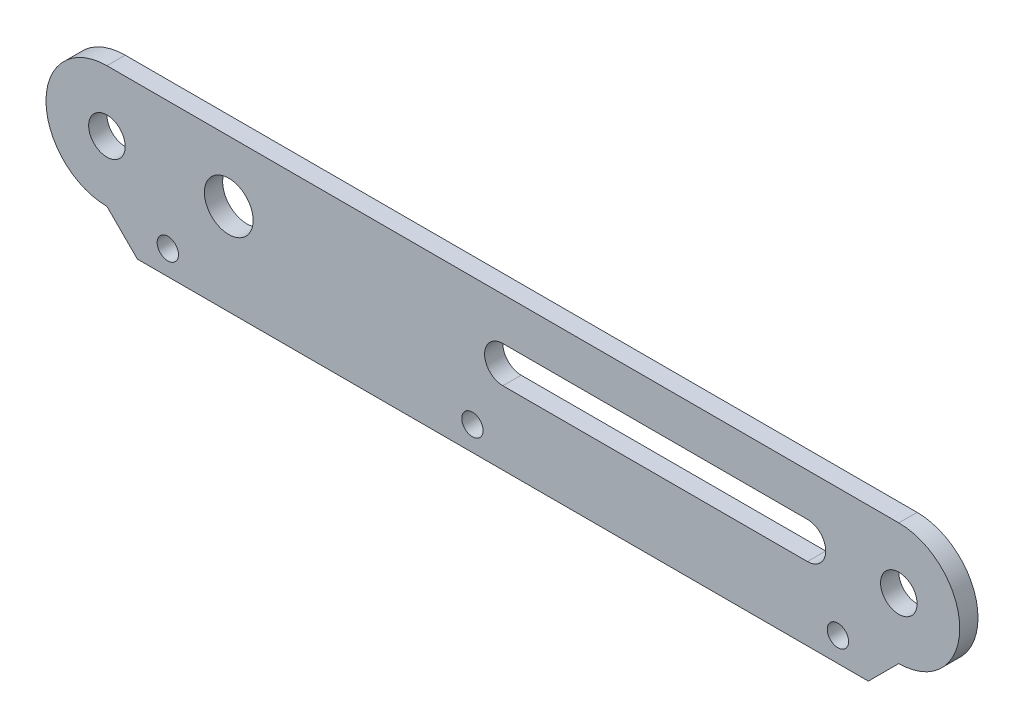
ISO-10303-21;
HEADER;
FILE_DESCRIPTION(('STEP AP214'),'2;1');
FILE_NAME('part.step','',(''),(''),'','','');
FILE_SCHEMA(('AUTOMOTIVE_DESIGN { 1 0 10303 214 1 1 1 1 }'));
ENDSEC;
DATA;
#1=APPLICATION_CONTEXT('core data for automotive mechanical design processes');
#2=APPLICATION_PROTOCOL_DEFINITION('international standard','automotive_design',2000,#1);
#3=PRODUCT_CONTEXT('',#1,'mechanical');
#4=PRODUCT('Part','Part','',(#3));
#5=PRODUCT_RELATED_PRODUCT_CATEGORY('part','',(#4));
#6=PRODUCT_DEFINITION_FORMATION('','',#4);
#7=PRODUCT_DEFINITION_CONTEXT('part definition',#1,'design');
#8=PRODUCT_DEFINITION('design','',#6,#7);
#9=PRODUCT_DEFINITION_SHAPE('','',#8);
#10=(LENGTH_UNIT() NAMED_UNIT(*) SI_UNIT(.MILLI.,.METRE.));
#11=(NAMED_UNIT(*) PLANE_ANGLE_UNIT() SI_UNIT($,.RADIAN.));
#12=(NAMED_UNIT(*) SI_UNIT($,.STERADIAN.) SOLID_ANGLE_UNIT());
#13=UNCERTAINTY_MEASURE_WITH_UNIT(LENGTH_MEASURE(1.E-05),#10,'distance_accuracy_value','');
#14=(GEOMETRIC_REPRESENTATION_CONTEXT(3) GLOBAL_UNCERTAINTY_ASSIGNED_CONTEXT((#13)) GLOBAL_UNIT_ASSIGNED_CONTEXT((#10,
#11,#12)) REPRESENTATION_CONTEXT('',''));
#15=CARTESIAN_POINT('',(0.,0.,0.));
#16=DIRECTION('',(0.,0.,1.));
#17=DIRECTION('',(1.,0.,0.));
#18=AXIS2_PLACEMENT_3D('',#15,#16,#17);
#19=CARTESIAN_POINT('',(0.,0.,3.));
#20=DIRECTION('',(0.,0.,1.));
#21=DIRECTION('',(1.,0.,0.));
#22=AXIS2_PLACEMENT_3D('',#19,#20,#21);
#23=PLANE('',#22);
#24=CARTESIAN_POINT('',(60.,-11.,3.));
#25=DIRECTION('',(0.,0.,1.));
#26=DIRECTION('',(1.,0.,0.));
#27=AXIS2_PLACEMENT_3D('',#24,#25,#26);
#28=CIRCLE('',#27,1.75);
#29=CARTESIAN_POINT('',(61.75,-11.,3.));
#30=VERTEX_POINT('',#29);
#31=EDGE_CURVE('E300',#30,#30,#28,.T.);
#32=ORIENTED_EDGE('',*,*,#31,.F.);
#33=EDGE_LOOP('',(#32));
#34=FACE_BOUND('',#33,.T.);
#35=DIRECTION('',(1.,0.,0.));
#36=VECTOR('',#35,1.);
#37=CARTESIAN_POINT('',(65.,-3.,3.));
#38=LINE('',#37,#36);
#39=CARTESIAN_POINT('',(65.,-3.,3.));
#40=VERTEX_POINT('',#39);
#41=CARTESIAN_POINT('',(115.,-3.,3.));
#42=VERTEX_POINT('',#41);
#43=EDGE_CURVE('E118',#40,#42,#38,.T.);
#44=ORIENTED_EDGE('',*,*,#43,.F.);
#45=CARTESIAN_POINT('',(65.,0.,3.));
#46=DIRECTION('',(0.,0.,1.));
#47=DIRECTION('',(1.,0.,0.));
#48=AXIS2_PLACEMENT_3D('',#45,#46,#47);
#49=CIRCLE('',#48,3.);
#50=CARTESIAN_POINT('',(65.,3.,3.));
#51=VERTEX_POINT('',#50);
#52=EDGE_CURVE('E110',#51,#40,#49,.T.);
#53=ORIENTED_EDGE('',*,*,#52,.F.);
#54=DIRECTION('',(-1.,0.,0.));
#55=VECTOR('',#54,1.);
#56=CARTESIAN_POINT('',(65.,3.,3.));
#57=LINE('',#56,#55);
#58=CARTESIAN_POINT('',(115.,3.,3.));
#59=VERTEX_POINT('',#58);
#60=EDGE_CURVE('E133',#59,#51,#57,.T.);
#61=ORIENTED_EDGE('',*,*,#60,.F.);
#62=CARTESIAN_POINT('',(115.,0.,3.));
#63=DIRECTION('',(0.,0.,1.));
#64=DIRECTION('',(1.,0.,0.));
#65=AXIS2_PLACEMENT_3D('',#62,#63,#64);
#66=CIRCLE('',#65,3.);
#67=EDGE_CURVE('E131',#42,#59,#66,.T.);
#68=ORIENTED_EDGE('',*,*,#67,.F.);
#69=EDGE_LOOP('',(#44,#53,#61,#68));
#70=FACE_BOUND('',#69,.T.);
#71=CARTESIAN_POINT('',(130.,0.,3.));
#72=DIRECTION('',(0.,0.,1.));
#73=DIRECTION('',(1.,0.,0.));
#74=AXIS2_PLACEMENT_3D('',#71,#72,#73);
#75=CIRCLE('',#74,2.99999999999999);
#76=CARTESIAN_POINT('',(133.,0.,3.));
#77=VERTEX_POINT('',#76);
#78=EDGE_CURVE('E149',#77,#77,#75,.T.);
#79=ORIENTED_EDGE('',*,*,#78,.F.);
#80=EDGE_LOOP('',(#79));
#81=FACE_BOUND('',#80,.T.);
#82=CARTESIAN_POINT('',(0.,0.,3.));
#83=DIRECTION('',(0.,0.,1.));
#84=DIRECTION('',(1.,0.,0.));
#85=AXIS2_PLACEMENT_3D('',#82,#83,#84);
#86=CIRCLE('',#85,3.);
#87=CARTESIAN_POINT('',(3.,0.,3.));
#88=VERTEX_POINT('',#87);
#89=EDGE_CURVE('E161',#88,#88,#86,.T.);
#90=ORIENTED_EDGE('',*,*,#89,.F.);
#91=EDGE_LOOP('',(#90));
#92=FACE_BOUND('',#91,.T.);
#93=CARTESIAN_POINT('',(0.,0.,3.));
#94=DIRECTION('',(0.,0.,1.));
#95=DIRECTION('',(1.,0.,0.));
#96=AXIS2_PLACEMENT_3D('',#93,#94,#95);
#97=CIRCLE('',#96,10.);
#98=CARTESIAN_POINT('',(0.,10.,3.));
#99=VERTEX_POINT('',#98);
#100=CARTESIAN_POINT('',(0.,-10.,3.));
#101=VERTEX_POINT('',#100);
#102=EDGE_CURVE('E167',#99,#101,#97,.T.);
#103=ORIENTED_EDGE('',*,*,#102,.T.);
#104=DIRECTION('',(0.707106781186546,-0.707106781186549,0.));
#105=VECTOR('',#104,1.);
#106=CARTESIAN_POINT('',(0.,-10.,3.));
#107=LINE('',#106,#105);
#108=CARTESIAN_POINT('',(4.99999999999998,-15.,3.));
#109=VERTEX_POINT('',#108);
#110=EDGE_CURVE('E170',#101,#109,#107,.T.);
#111=ORIENTED_EDGE('',*,*,#110,.T.);
#112=DIRECTION('',(1.,0.,0.));
#113=VECTOR('',#112,1.);
#114=CARTESIAN_POINT('',(4.99999999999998,-15.,3.));
#115=LINE('',#114,#113);
#116=CARTESIAN_POINT('',(125.,-15.,3.));
#117=VERTEX_POINT('',#116);
#118=EDGE_CURVE('E173',#109,#117,#115,.T.);
#119=ORIENTED_EDGE('',*,*,#118,.T.);
#120=DIRECTION('',(0.707106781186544,0.707106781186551,0.));
#121=VECTOR('',#120,1.);
#122=CARTESIAN_POINT('',(125.,-15.,3.));
#123=LINE('',#122,#121);
#124=CARTESIAN_POINT('',(130.,-10.,3.));
#125=VERTEX_POINT('',#124);
#126=EDGE_CURVE('E175',#117,#125,#123,.T.);
#127=ORIENTED_EDGE('',*,*,#126,.T.);
#128=CARTESIAN_POINT('',(130.,0.,3.));
#129=DIRECTION('',(0.,0.,1.));
#130=DIRECTION('',(1.,0.,0.));
#131=AXIS2_PLACEMENT_3D('',#128,#129,#130);
#132=CIRCLE('',#131,10.);
#133=CARTESIAN_POINT('',(130.,10.,3.));
#134=VERTEX_POINT('',#133);
#135=EDGE_CURVE('E177',#125,#134,#132,.T.);
#136=ORIENTED_EDGE('',*,*,#135,.T.);
#137=DIRECTION('',(-1.,0.,0.));
#138=VECTOR('',#137,1.);
#139=CARTESIAN_POINT('',(0.,10.,3.));
#140=LINE('',#139,#138);
#141=EDGE_CURVE('E179',#134,#99,#140,.T.);
#142=ORIENTED_EDGE('',*,*,#141,.T.);
#143=EDGE_LOOP('',(#103,#111,#119,#127,#136,#142));
#144=FACE_BOUND('',#143,.T.);
#145=CARTESIAN_POINT('',(20.,0.,3.));
#146=DIRECTION('',(0.,0.,1.));
#147=DIRECTION('',(1.,0.,0.));
#148=AXIS2_PLACEMENT_3D('',#145,#146,#147);
#149=CIRCLE('',#148,4.);
#150=CARTESIAN_POINT('',(24.,0.,3.));
#151=VERTEX_POINT('',#150);
#152=EDGE_CURVE('E155',#151,#151,#149,.T.);
#153=ORIENTED_EDGE('',*,*,#152,.F.);
#154=EDGE_LOOP('',(#153));
#155=FACE_BOUND('',#154,.T.);
#156=CARTESIAN_POINT('',(10.,-11.,3.));
#157=DIRECTION('',(0.,0.,1.));
#158=DIRECTION('',(1.,0.,0.));
#159=AXIS2_PLACEMENT_3D('',#156,#157,#158);
#160=CIRCLE('',#159,1.75);
#161=CARTESIAN_POINT('',(11.75,-11.,3.));
#162=VERTEX_POINT('',#161);
#163=EDGE_CURVE('E139',#162,#162,#160,.T.);
#164=ORIENTED_EDGE('',*,*,#163,.F.);
#165=EDGE_LOOP('',(#164));
#166=FACE_BOUND('',#165,.T.);
#167=CARTESIAN_POINT('',(120.,-11.,3.));
#168=DIRECTION('',(0.,0.,1.));
#169=DIRECTION('',(1.,0.,0.));
#170=AXIS2_PLACEMENT_3D('',#167,#168,#169);
#171=CIRCLE('',#170,1.75);
#172=CARTESIAN_POINT('',(121.75,-11.,3.));
#173=VERTEX_POINT('',#172);
#174=EDGE_CURVE('E291',#173,#173,#171,.T.);
#175=ORIENTED_EDGE('',*,*,#174,.F.);
#176=EDGE_LOOP('',(#175));
#177=FACE_BOUND('',#176,.T.);
#178=ADVANCED_FACE('F33',(#34,#70,#81,#92,#144,#155,#166,#177),#23,.T.);
#179=CARTESIAN_POINT('',(0.,0.,0.));
#180=DIRECTION('',(0.,0.,1.));
#181=DIRECTION('',(1.,0.,0.));
#182=AXIS2_PLACEMENT_3D('',#179,#180,#181);
#183=PLANE('',#182);
#184=CARTESIAN_POINT('',(130.,0.,0.));
#185=DIRECTION('',(0.,0.,1.));
#186=DIRECTION('',(1.,0.,0.));
#187=AXIS2_PLACEMENT_3D('',#184,#185,#186);
#188=CIRCLE('',#187,2.99999999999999);
#189=CARTESIAN_POINT('',(133.,0.,0.));
#190=VERTEX_POINT('',#189);
#191=EDGE_CURVE('E126',#190,#190,#188,.T.);
#192=ORIENTED_EDGE('',*,*,#191,.T.);
#193=EDGE_LOOP('',(#192));
#194=FACE_BOUND('',#193,.T.);
#195=CARTESIAN_POINT('',(20.,0.,0.));
#196=DIRECTION('',(0.,0.,1.));
#197=DIRECTION('',(1.,0.,0.));
#198=AXIS2_PLACEMENT_3D('',#195,#196,#197);
#199=CIRCLE('',#198,4.);
#200=CARTESIAN_POINT('',(24.,0.,0.));
#201=VERTEX_POINT('',#200);
#202=EDGE_CURVE('E152',#201,#201,#199,.T.);
#203=ORIENTED_EDGE('',*,*,#202,.T.);
#204=EDGE_LOOP('',(#203));
#205=FACE_BOUND('',#204,.T.);
#206=CARTESIAN_POINT('',(0.,0.,0.));
#207=DIRECTION('',(0.,0.,1.));
#208=DIRECTION('',(1.,0.,0.));
#209=AXIS2_PLACEMENT_3D('',#206,#207,#208);
#210=CIRCLE('',#209,3.);
#211=CARTESIAN_POINT('',(3.,0.,0.));
#212=VERTEX_POINT('',#211);
#213=EDGE_CURVE('E158',#212,#212,#210,.T.);
#214=ORIENTED_EDGE('',*,*,#213,.T.);
#215=EDGE_LOOP('',(#214));
#216=FACE_BOUND('',#215,.T.);
#217=CARTESIAN_POINT('',(0.,0.,0.));
#218=DIRECTION('',(0.,0.,1.));
#219=DIRECTION('',(1.,0.,0.));
#220=AXIS2_PLACEMENT_3D('',#217,#218,#219);
#221=CIRCLE('',#220,10.);
#222=CARTESIAN_POINT('',(0.,10.,0.));
#223=VERTEX_POINT('',#222);
#224=CARTESIAN_POINT('',(0.,-10.,0.));
#225=VERTEX_POINT('',#224);
#226=EDGE_CURVE('E164',#223,#225,#221,.T.);
#227=ORIENTED_EDGE('',*,*,#226,.F.);
#228=DIRECTION('',(-1.,0.,0.));
#229=VECTOR('',#228,1.);
#230=CARTESIAN_POINT('',(0.,10.,0.));
#231=LINE('',#230,#229);
#232=CARTESIAN_POINT('',(130.,10.,0.));
#233=VERTEX_POINT('',#232);
#234=EDGE_CURVE('E171',#233,#223,#231,.T.);
#235=ORIENTED_EDGE('',*,*,#234,.F.);
#236=CARTESIAN_POINT('',(130.,0.,0.));
#237=DIRECTION('',(0.,0.,1.));
#238=DIRECTION('',(1.,0.,0.));
#239=AXIS2_PLACEMENT_3D('',#236,#237,#238);
#240=CIRCLE('',#239,10.);
#241=CARTESIAN_POINT('',(130.,-10.,0.));
#242=VERTEX_POINT('',#241);
#243=EDGE_CURVE('E190',#242,#233,#240,.T.);
#244=ORIENTED_EDGE('',*,*,#243,.F.);
#245=DIRECTION('',(0.707106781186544,0.707106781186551,0.));
#246=VECTOR('',#245,1.);
#247=CARTESIAN_POINT('',(125.,-15.,0.));
#248=LINE('',#247,#246);
#249=CARTESIAN_POINT('',(125.,-15.,0.));
#250=VERTEX_POINT('',#249);
#251=EDGE_CURVE('E188',#250,#242,#248,.T.);
#252=ORIENTED_EDGE('',*,*,#251,.F.);
#253=DIRECTION('',(1.,0.,0.));
#254=VECTOR('',#253,1.);
#255=CARTESIAN_POINT('',(4.99999999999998,-15.,0.));
#256=LINE('',#255,#254);
#257=CARTESIAN_POINT('',(4.99999999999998,-15.,0.));
#258=VERTEX_POINT('',#257);
#259=EDGE_CURVE('E186',#258,#250,#256,.T.);
#260=ORIENTED_EDGE('',*,*,#259,.F.);
#261=DIRECTION('',(0.707106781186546,-0.707106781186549,0.));
#262=VECTOR('',#261,1.);
#263=CARTESIAN_POINT('',(0.,-10.,0.));
#264=LINE('',#263,#262);
#265=EDGE_CURVE('E184',#225,#258,#264,.T.);
#266=ORIENTED_EDGE('',*,*,#265,.F.);
#267=EDGE_LOOP('',(#227,#235,#244,#252,#260,#266));
#268=FACE_BOUND('',#267,.T.);
#269=CARTESIAN_POINT('',(65.,0.,0.));
#270=DIRECTION('',(0.,0.,1.));
#271=DIRECTION('',(1.,0.,0.));
#272=AXIS2_PLACEMENT_3D('',#269,#270,#271);
#273=CIRCLE('',#272,3.);
#274=CARTESIAN_POINT('',(65.,3.,0.));
#275=VERTEX_POINT('',#274);
#276=CARTESIAN_POINT('',(65.,-3.,0.));
#277=VERTEX_POINT('',#276);
#278=EDGE_CURVE('E56',#275,#277,#273,.T.);
#279=ORIENTED_EDGE('',*,*,#278,.T.);
#280=DIRECTION('',(1.,0.,0.));
#281=VECTOR('',#280,1.);
#282=CARTESIAN_POINT('',(65.,-3.,0.));
#283=LINE('',#282,#281);
#284=CARTESIAN_POINT('',(115.,-3.,0.));
#285=VERTEX_POINT('',#284);
#286=EDGE_CURVE('E125',#277,#285,#283,.T.);
#287=ORIENTED_EDGE('',*,*,#286,.T.);
#288=CARTESIAN_POINT('',(115.,0.,0.));
#289=DIRECTION('',(0.,0.,1.));
#290=DIRECTION('',(1.,0.,0.));
#291=AXIS2_PLACEMENT_3D('',#288,#289,#290);
#292=CIRCLE('',#291,3.);
#293=CARTESIAN_POINT('',(115.,3.,0.));
#294=VERTEX_POINT('',#293);
#295=EDGE_CURVE('E141',#285,#294,#292,.T.);
#296=ORIENTED_EDGE('',*,*,#295,.T.);
#297=DIRECTION('',(-1.,0.,0.));
#298=VECTOR('',#297,1.);
#299=CARTESIAN_POINT('',(65.,3.,0.));
#300=LINE('',#299,#298);
#301=EDGE_CURVE('E119',#294,#275,#300,.T.);
#302=ORIENTED_EDGE('',*,*,#301,.T.);
#303=EDGE_LOOP('',(#279,#287,#296,#302));
#304=FACE_BOUND('',#303,.T.);
#305=CARTESIAN_POINT('',(10.,-11.,0.));
#306=DIRECTION('',(0.,0.,1.));
#307=DIRECTION('',(1.,0.,0.));
#308=AXIS2_PLACEMENT_3D('',#305,#306,#307);
#309=CIRCLE('',#308,1.75);
#310=CARTESIAN_POINT('',(11.75,-11.,0.));
#311=VERTEX_POINT('',#310);
#312=EDGE_CURVE('E303',#311,#311,#309,.T.);
#313=ORIENTED_EDGE('',*,*,#312,.T.);
#314=EDGE_LOOP('',(#313));
#315=FACE_BOUND('',#314,.T.);
#316=CARTESIAN_POINT('',(60.,-11.,0.));
#317=DIRECTION('',(0.,0.,1.));
#318=DIRECTION('',(1.,0.,0.));
#319=AXIS2_PLACEMENT_3D('',#316,#317,#318);
#320=CIRCLE('',#319,1.75);
#321=CARTESIAN_POINT('',(61.75,-11.,0.));
#322=VERTEX_POINT('',#321);
#323=EDGE_CURVE('E297',#322,#322,#320,.T.);
#324=ORIENTED_EDGE('',*,*,#323,.T.);
#325=EDGE_LOOP('',(#324));
#326=FACE_BOUND('',#325,.T.);
#327=CARTESIAN_POINT('',(120.,-11.,0.));
#328=DIRECTION('',(0.,0.,1.));
#329=DIRECTION('',(1.,0.,0.));
#330=AXIS2_PLACEMENT_3D('',#327,#328,#329);
#331=CIRCLE('',#330,1.75);
#332=CARTESIAN_POINT('',(121.75,-11.,0.));
#333=VERTEX_POINT('',#332);
#334=EDGE_CURVE('E294',#333,#333,#331,.T.);
#335=ORIENTED_EDGE('',*,*,#334,.T.);
#336=EDGE_LOOP('',(#335));
#337=FACE_BOUND('',#336,.T.);
#338=ADVANCED_FACE('F214',(#194,#205,#216,#268,#304,#315,#326,#337),#183,.F.);
#339=CARTESIAN_POINT('',(0.,0.,3.));
#340=DIRECTION('',(0.,0.,-1.));
#341=DIRECTION('',(-1.,0.,0.));
#342=AXIS2_PLACEMENT_3D('',#339,#340,#341);
#343=CYLINDRICAL_SURFACE('',#342,10.);
#344=ORIENTED_EDGE('',*,*,#226,.T.);
#345=DIRECTION('',(0.,0.,-1.));
#346=VECTOR('',#345,1.);
#347=CARTESIAN_POINT('',(0.,-10.,3.));
#348=LINE('',#347,#346);
#349=EDGE_CURVE('E11',#101,#225,#348,.T.);
#350=ORIENTED_EDGE('',*,*,#349,.F.);
#351=ORIENTED_EDGE('',*,*,#102,.F.);
#352=DIRECTION('',(0.,0.,-1.));
#353=VECTOR('',#352,1.);
#354=CARTESIAN_POINT('',(0.,10.,3.));
#355=LINE('',#354,#353);
#356=EDGE_CURVE('E181',#99,#223,#355,.T.);
#357=ORIENTED_EDGE('',*,*,#356,.T.);
#358=EDGE_LOOP('',(#344,#350,#351,#357));
#359=FACE_BOUND('',#358,.T.);
#360=ADVANCED_FACE('F35',(#359),#343,.T.);
#361=CARTESIAN_POINT('',(0.,-10.,3.));
#362=DIRECTION('',(0.707106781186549,0.707106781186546,0.));
#363=DIRECTION('',(-0.707106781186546,0.707106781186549,0.));
#364=AXIS2_PLACEMENT_3D('',#361,#362,#363);
#365=PLANE('',#364);
#366=ORIENTED_EDGE('',*,*,#265,.T.);
#367=DIRECTION('',(0.,0.,-1.));
#368=VECTOR('',#367,1.);
#369=CARTESIAN_POINT('',(4.99999999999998,-15.,3.));
#370=LINE('',#369,#368);
#371=EDGE_CURVE('E41',#109,#258,#370,.T.);
#372=ORIENTED_EDGE('',*,*,#371,.F.);
#373=ORIENTED_EDGE('',*,*,#110,.F.);
#374=ORIENTED_EDGE('',*,*,#349,.T.);
#375=EDGE_LOOP('',(#366,#372,#373,#374));
#376=FACE_BOUND('',#375,.T.);
#377=ADVANCED_FACE('F232',(#376),#365,.F.);
#378=CARTESIAN_POINT('',(4.99999999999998,-15.,3.));
#379=DIRECTION('',(0.,1.,0.));
#380=DIRECTION('',(0.,0.,1.));
#381=AXIS2_PLACEMENT_3D('',#378,#379,#380);
#382=PLANE('',#381);
#383=ORIENTED_EDGE('',*,*,#259,.T.);
#384=DIRECTION('',(0.,0.,-1.));
#385=VECTOR('',#384,1.);
#386=CARTESIAN_POINT('',(125.,-15.,3.));
#387=LINE('',#386,#385);
#388=EDGE_CURVE('E201',#117,#250,#387,.T.);
#389=ORIENTED_EDGE('',*,*,#388,.F.);
#390=ORIENTED_EDGE('',*,*,#118,.F.);
#391=ORIENTED_EDGE('',*,*,#371,.T.);
#392=EDGE_LOOP('',(#383,#389,#390,#391));
#393=FACE_BOUND('',#392,.T.);
#394=ADVANCED_FACE('F208',(#393),#382,.F.);
#395=CARTESIAN_POINT('',(125.,-15.,3.));
#396=DIRECTION('',(-0.707106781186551,0.707106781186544,0.));
#397=DIRECTION('',(-0.707106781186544,-0.707106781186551,0.));
#398=AXIS2_PLACEMENT_3D('',#395,#396,#397);
#399=PLANE('',#398);
#400=ORIENTED_EDGE('',*,*,#251,.T.);
#401=DIRECTION('',(0.,0.,-1.));
#402=VECTOR('',#401,1.);
#403=CARTESIAN_POINT('',(130.,-10.,3.));
#404=LINE('',#403,#402);
#405=EDGE_CURVE('E198',#125,#242,#404,.T.);
#406=ORIENTED_EDGE('',*,*,#405,.F.);
#407=ORIENTED_EDGE('',*,*,#126,.F.);
#408=ORIENTED_EDGE('',*,*,#388,.T.);
#409=EDGE_LOOP('',(#400,#406,#407,#408));
#410=FACE_BOUND('',#409,.T.);
#411=ADVANCED_FACE('F220',(#410),#399,.F.);
#412=CARTESIAN_POINT('',(130.,0.,3.));
#413=DIRECTION('',(0.,0.,-1.));
#414=DIRECTION('',(-1.,0.,0.));
#415=AXIS2_PLACEMENT_3D('',#412,#413,#414);
#416=CYLINDRICAL_SURFACE('',#415,10.);
#417=ORIENTED_EDGE('',*,*,#243,.T.);
#418=DIRECTION('',(0.,0.,-1.));
#419=VECTOR('',#418,1.);
#420=CARTESIAN_POINT('',(130.,10.,3.));
#421=LINE('',#420,#419);
#422=EDGE_CURVE('E195',#134,#233,#421,.T.);
#423=ORIENTED_EDGE('',*,*,#422,.F.);
#424=ORIENTED_EDGE('',*,*,#135,.F.);
#425=ORIENTED_EDGE('',*,*,#405,.T.);
#426=EDGE_LOOP('',(#417,#423,#424,#425));
#427=FACE_BOUND('',#426,.T.);
#428=ADVANCED_FACE('F224',(#427),#416,.T.);
#429=CARTESIAN_POINT('',(0.,10.,3.));
#430=DIRECTION('',(0.,-1.,0.));
#431=DIRECTION('',(0.,0.,-1.));
#432=AXIS2_PLACEMENT_3D('',#429,#430,#431);
#433=PLANE('',#432);
#434=ORIENTED_EDGE('',*,*,#234,.T.);
#435=ORIENTED_EDGE('',*,*,#356,.F.);
#436=ORIENTED_EDGE('',*,*,#141,.F.);
#437=ORIENTED_EDGE('',*,*,#422,.T.);
#438=EDGE_LOOP('',(#434,#435,#436,#437));
#439=FACE_BOUND('',#438,.T.);
#440=ADVANCED_FACE('F235',(#439),#433,.F.);
#441=CARTESIAN_POINT('',(0.,0.,3.));
#442=DIRECTION('',(0.,0.,-1.));
#443=DIRECTION('',(-1.,0.,0.));
#444=AXIS2_PLACEMENT_3D('',#441,#442,#443);
#445=CYLINDRICAL_SURFACE('',#444,3.);
#446=ORIENTED_EDGE('',*,*,#89,.T.);
#447=EDGE_LOOP('',(#446));
#448=FACE_BOUND('',#447,.T.);
#449=ORIENTED_EDGE('',*,*,#213,.F.);
#450=EDGE_LOOP('',(#449));
#451=FACE_BOUND('',#450,.T.);
#452=ADVANCED_FACE('F237',(#448,#451),#445,.F.);
#453=CARTESIAN_POINT('',(20.,0.,3.));
#454=DIRECTION('',(0.,0.,-1.));
#455=DIRECTION('',(-1.,0.,0.));
#456=AXIS2_PLACEMENT_3D('',#453,#454,#455);
#457=CYLINDRICAL_SURFACE('',#456,4.);
#458=ORIENTED_EDGE('',*,*,#152,.T.);
#459=EDGE_LOOP('',(#458));
#460=FACE_BOUND('',#459,.T.);
#461=ORIENTED_EDGE('',*,*,#202,.F.);
#462=EDGE_LOOP('',(#461));
#463=FACE_BOUND('',#462,.T.);
#464=ADVANCED_FACE('F243',(#460,#463),#457,.F.);
#465=CARTESIAN_POINT('',(130.,0.,3.));
#466=DIRECTION('',(0.,0.,-1.));
#467=DIRECTION('',(-1.,0.,0.));
#468=AXIS2_PLACEMENT_3D('',#465,#466,#467);
#469=CYLINDRICAL_SURFACE('',#468,2.99999999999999);
#470=ORIENTED_EDGE('',*,*,#78,.T.);
#471=EDGE_LOOP('',(#470));
#472=FACE_BOUND('',#471,.T.);
#473=ORIENTED_EDGE('',*,*,#191,.F.);
#474=EDGE_LOOP('',(#473));
#475=FACE_BOUND('',#474,.T.);
#476=ADVANCED_FACE('F259',(#472,#475),#469,.F.);
#477=CARTESIAN_POINT('',(65.,0.,3.));
#478=DIRECTION('',(0.,0.,-1.));
#479=DIRECTION('',(-1.,0.,0.));
#480=AXIS2_PLACEMENT_3D('',#477,#478,#479);
#481=CYLINDRICAL_SURFACE('',#480,3.);
#482=ORIENTED_EDGE('',*,*,#278,.F.);
#483=DIRECTION('',(0.,0.,-1.));
#484=VECTOR('',#483,1.);
#485=CARTESIAN_POINT('',(65.,3.,3.));
#486=LINE('',#485,#484);
#487=EDGE_CURVE('E114',#51,#275,#486,.T.);
#488=ORIENTED_EDGE('',*,*,#487,.F.);
#489=ORIENTED_EDGE('',*,*,#52,.T.);
#490=DIRECTION('',(0.,0.,-1.));
#491=VECTOR('',#490,1.);
#492=CARTESIAN_POINT('',(65.,-3.,3.));
#493=LINE('',#492,#491);
#494=EDGE_CURVE('E113',#40,#277,#493,.T.);
#495=ORIENTED_EDGE('',*,*,#494,.T.);
#496=EDGE_LOOP('',(#482,#488,#489,#495));
#497=FACE_BOUND('',#496,.T.);
#498=ADVANCED_FACE('F112',(#497),#481,.F.);
#499=CARTESIAN_POINT('',(65.,-3.,3.));
#500=DIRECTION('',(0.,1.,0.));
#501=DIRECTION('',(0.,0.,1.));
#502=AXIS2_PLACEMENT_3D('',#499,#500,#501);
#503=PLANE('',#502);
#504=ORIENTED_EDGE('',*,*,#286,.F.);
#505=ORIENTED_EDGE('',*,*,#494,.F.);
#506=ORIENTED_EDGE('',*,*,#43,.T.);
#507=DIRECTION('',(0.,0.,-1.));
#508=VECTOR('',#507,1.);
#509=CARTESIAN_POINT('',(115.,-3.,3.));
#510=LINE('',#509,#508);
#511=EDGE_CURVE('E127',#42,#285,#510,.T.);
#512=ORIENTED_EDGE('',*,*,#511,.T.);
#513=EDGE_LOOP('',(#504,#505,#506,#512));
#514=FACE_BOUND('',#513,.T.);
#515=ADVANCED_FACE('F122',(#514),#503,.T.);
#516=CARTESIAN_POINT('',(115.,0.,3.));
#517=DIRECTION('',(0.,0.,-1.));
#518=DIRECTION('',(-1.,0.,0.));
#519=AXIS2_PLACEMENT_3D('',#516,#517,#518);
#520=CYLINDRICAL_SURFACE('',#519,3.);
#521=ORIENTED_EDGE('',*,*,#295,.F.);
#522=ORIENTED_EDGE('',*,*,#511,.F.);
#523=ORIENTED_EDGE('',*,*,#67,.T.);
#524=DIRECTION('',(0.,0.,-1.));
#525=VECTOR('',#524,1.);
#526=CARTESIAN_POINT('',(115.,3.,3.));
#527=LINE('',#526,#525);
#528=EDGE_CURVE('E48',#59,#294,#527,.T.);
#529=ORIENTED_EDGE('',*,*,#528,.T.);
#530=EDGE_LOOP('',(#521,#522,#523,#529));
#531=FACE_BOUND('',#530,.T.);
#532=ADVANCED_FACE('F268',(#531),#520,.F.);
#533=CARTESIAN_POINT('',(65.,3.,3.));
#534=DIRECTION('',(0.,-1.,0.));
#535=DIRECTION('',(0.,0.,-1.));
#536=AXIS2_PLACEMENT_3D('',#533,#534,#535);
#537=PLANE('',#536);
#538=ORIENTED_EDGE('',*,*,#301,.F.);
#539=ORIENTED_EDGE('',*,*,#528,.F.);
#540=ORIENTED_EDGE('',*,*,#60,.T.);
#541=ORIENTED_EDGE('',*,*,#487,.T.);
#542=EDGE_LOOP('',(#538,#539,#540,#541));
#543=FACE_BOUND('',#542,.T.);
#544=ADVANCED_FACE('F271',(#543),#537,.T.);
#545=CARTESIAN_POINT('',(10.,-11.,3.));
#546=DIRECTION('',(0.,0.,-1.));
#547=DIRECTION('',(-1.,0.,0.));
#548=AXIS2_PLACEMENT_3D('',#545,#546,#547);
#549=CYLINDRICAL_SURFACE('',#548,1.75);
#550=ORIENTED_EDGE('',*,*,#163,.T.);
#551=EDGE_LOOP('',(#550));
#552=FACE_BOUND('',#551,.T.);
#553=ORIENTED_EDGE('',*,*,#312,.F.);
#554=EDGE_LOOP('',(#553));
#555=FACE_BOUND('',#554,.T.);
#556=ADVANCED_FACE('F275',(#552,#555),#549,.F.);
#557=CARTESIAN_POINT('',(60.,-11.,3.));
#558=DIRECTION('',(0.,0.,-1.));
#559=DIRECTION('',(-1.,0.,0.));
#560=AXIS2_PLACEMENT_3D('',#557,#558,#559);
#561=CYLINDRICAL_SURFACE('',#560,1.75);
#562=ORIENTED_EDGE('',*,*,#31,.T.);
#563=EDGE_LOOP('',(#562));
#564=FACE_BOUND('',#563,.T.);
#565=ORIENTED_EDGE('',*,*,#323,.F.);
#566=EDGE_LOOP('',(#565));
#567=FACE_BOUND('',#566,.T.);
#568=ADVANCED_FACE('F278',(#564,#567),#561,.F.);
#569=CARTESIAN_POINT('',(120.,-11.,3.));
#570=DIRECTION('',(0.,0.,-1.));
#571=DIRECTION('',(-1.,0.,0.));
#572=AXIS2_PLACEMENT_3D('',#569,#570,#571);
#573=CYLINDRICAL_SURFACE('',#572,1.75);
#574=ORIENTED_EDGE('',*,*,#174,.T.);
#575=EDGE_LOOP('',(#574));
#576=FACE_BOUND('',#575,.T.);
#577=ORIENTED_EDGE('',*,*,#334,.F.);
#578=EDGE_LOOP('',(#577));
#579=FACE_BOUND('',#578,.T.);
#580=ADVANCED_FACE('F282',(#576,#579),#573,.F.);
#581=CLOSED_SHELL('',(#178,#338,#360,#377,#394,#411,#428,#440,#452,#464,#476,#498,#515,#532,
#544,#556,#568,#580));
#582=MANIFOLD_SOLID_BREP('B2',#581);
#583=ADVANCED_BREP_SHAPE_REPRESENTATION('',(#18,#582),#14);
#584=SHAPE_DEFINITION_REPRESENTATION(#9,#583);
ENDSEC;
END-ISO-10303-21;
